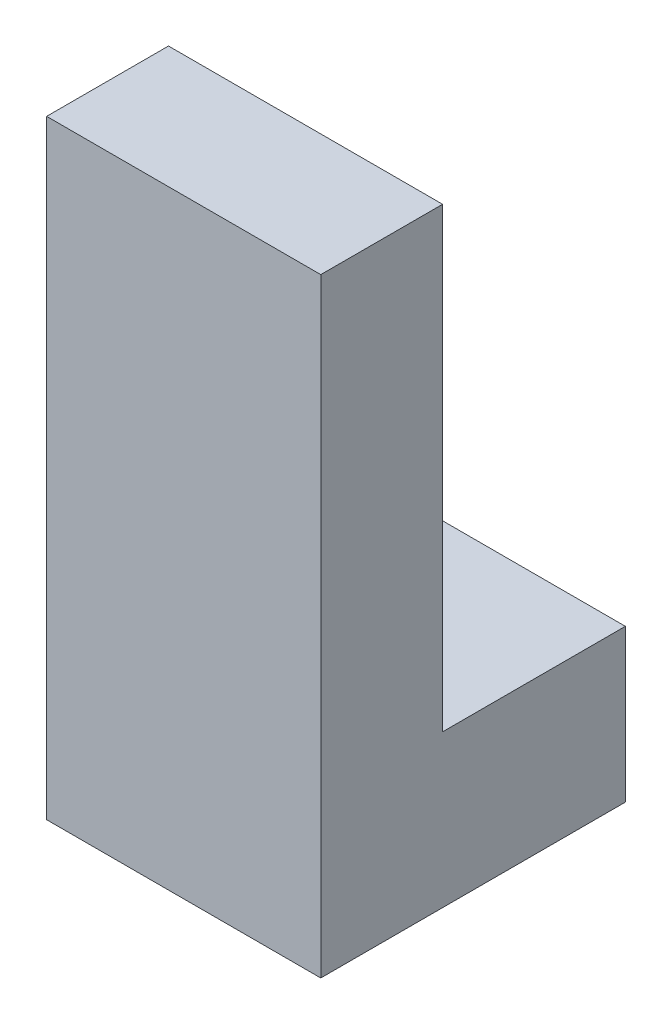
ISO-10303-21;
HEADER;
FILE_DESCRIPTION(('STEP AP214'),'2;1');
FILE_NAME('part.step','',(''),(''),'','','');
FILE_SCHEMA(('AUTOMOTIVE_DESIGN { 1 0 10303 214 1 1 1 1 }'));
ENDSEC;
DATA;
#1=APPLICATION_CONTEXT('core data for automotive mechanical design processes');
#2=APPLICATION_PROTOCOL_DEFINITION('international standard','automotive_design',2000,#1);
#3=PRODUCT_CONTEXT('',#1,'mechanical');
#4=PRODUCT('Part','Part','',(#3));
#5=PRODUCT_RELATED_PRODUCT_CATEGORY('part','',(#4));
#6=PRODUCT_DEFINITION_FORMATION('','',#4);
#7=PRODUCT_DEFINITION_CONTEXT('part definition',#1,'design');
#8=PRODUCT_DEFINITION('design','',#6,#7);
#9=PRODUCT_DEFINITION_SHAPE('','',#8);
#10=(LENGTH_UNIT() NAMED_UNIT(*) SI_UNIT(.MILLI.,.METRE.));
#11=(NAMED_UNIT(*) PLANE_ANGLE_UNIT() SI_UNIT($,.RADIAN.));
#12=(NAMED_UNIT(*) SI_UNIT($,.STERADIAN.) SOLID_ANGLE_UNIT());
#13=UNCERTAINTY_MEASURE_WITH_UNIT(LENGTH_MEASURE(1.E-05),#10,'distance_accuracy_value','');
#14=(GEOMETRIC_REPRESENTATION_CONTEXT(3) GLOBAL_UNCERTAINTY_ASSIGNED_CONTEXT((#13)) GLOBAL_UNIT_ASSIGNED_CONTEXT((#10,
#11,#12)) REPRESENTATION_CONTEXT('',''));
#15=CARTESIAN_POINT('',(0.,0.,0.));
#16=DIRECTION('',(0.,0.,1.));
#17=DIRECTION('',(1.,0.,0.));
#18=AXIS2_PLACEMENT_3D('',#15,#16,#17);
#19=CARTESIAN_POINT('',(0.,8.,0.));
#20=DIRECTION('',(1.,0.,0.));
#21=DIRECTION('',(0.,0.,-1.));
#22=AXIS2_PLACEMENT_3D('',#19,#20,#21);
#23=PLANE('',#22);
#24=DIRECTION('',(0.,1.,0.));
#25=VECTOR('',#24,1.);
#26=CARTESIAN_POINT('',(0.,-4.32666153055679,-1.6));
#27=LINE('',#26,#25);
#28=CARTESIAN_POINT('',(0.,2.,-1.6));
#29=VERTEX_POINT('',#28);
#30=CARTESIAN_POINT('',(0.,8.,-1.6));
#31=VERTEX_POINT('',#30);
#32=EDGE_CURVE('E56',#29,#31,#27,.T.);
#33=ORIENTED_EDGE('',*,*,#32,.F.);
#34=DIRECTION('',(0.,0.,1.));
#35=VECTOR('',#34,1.);
#36=CARTESIAN_POINT('',(0.,2.,-4.));
#37=LINE('',#36,#35);
#38=CARTESIAN_POINT('',(0.,2.,-4.));
#39=VERTEX_POINT('',#38);
#40=EDGE_CURVE('E92',#39,#29,#37,.T.);
#41=ORIENTED_EDGE('',*,*,#40,.F.);
#42=DIRECTION('',(0.,-1.,0.));
#43=VECTOR('',#42,1.);
#44=CARTESIAN_POINT('',(0.,8.,-4.));
#45=LINE('',#44,#43);
#46=CARTESIAN_POINT('',(0.,0.,-4.));
#47=VERTEX_POINT('',#46);
#48=EDGE_CURVE('E85',#39,#47,#45,.T.);
#49=ORIENTED_EDGE('',*,*,#48,.T.);
#50=DIRECTION('',(0.,0.,1.));
#51=VECTOR('',#50,1.);
#52=CARTESIAN_POINT('',(0.,0.,0.));
#53=LINE('',#52,#51);
#54=CARTESIAN_POINT('',(0.,0.,0.));
#55=VERTEX_POINT('',#54);
#56=EDGE_CURVE('E89',#47,#55,#53,.T.);
#57=ORIENTED_EDGE('',*,*,#56,.T.);
#58=DIRECTION('',(0.,-1.,0.));
#59=VECTOR('',#58,1.);
#60=CARTESIAN_POINT('',(0.,8.,0.));
#61=LINE('',#60,#59);
#62=CARTESIAN_POINT('',(0.,8.,0.));
#63=VERTEX_POINT('',#62);
#64=EDGE_CURVE('E12',#63,#55,#61,.T.);
#65=ORIENTED_EDGE('',*,*,#64,.F.);
#66=DIRECTION('',(0.,0.,1.));
#67=VECTOR('',#66,1.);
#68=CARTESIAN_POINT('',(0.,8.,0.));
#69=LINE('',#68,#67);
#70=EDGE_CURVE('E107',#31,#63,#69,.T.);
#71=ORIENTED_EDGE('',*,*,#70,.F.);
#72=EDGE_LOOP('',(#33,#41,#49,#57,#65,#71));
#73=FACE_BOUND('',#72,.T.);
#74=ADVANCED_FACE('F41',(#73),#23,.F.);
#75=CARTESIAN_POINT('',(0.,8.,0.));
#76=DIRECTION('',(0.,0.,-1.));
#77=DIRECTION('',(-1.,0.,0.));
#78=AXIS2_PLACEMENT_3D('',#75,#76,#77);
#79=PLANE('',#78);
#80=DIRECTION('',(1.,0.,0.));
#81=VECTOR('',#80,1.);
#82=CARTESIAN_POINT('',(0.,0.,0.));
#83=LINE('',#82,#81);
#84=CARTESIAN_POINT('',(3.6,0.,0.));
#85=VERTEX_POINT('',#84);
#86=EDGE_CURVE('E111',#55,#85,#83,.T.);
#87=ORIENTED_EDGE('',*,*,#86,.T.);
#88=DIRECTION('',(0.,-1.,0.));
#89=VECTOR('',#88,1.);
#90=CARTESIAN_POINT('',(3.6,8.,0.));
#91=LINE('',#90,#89);
#92=CARTESIAN_POINT('',(3.6,8.,0.));
#93=VERTEX_POINT('',#92);
#94=EDGE_CURVE('E49',#93,#85,#91,.T.);
#95=ORIENTED_EDGE('',*,*,#94,.F.);
#96=DIRECTION('',(1.,0.,0.));
#97=VECTOR('',#96,1.);
#98=CARTESIAN_POINT('',(0.,8.,0.));
#99=LINE('',#98,#97);
#100=EDGE_CURVE('E65',#63,#93,#99,.T.);
#101=ORIENTED_EDGE('',*,*,#100,.F.);
#102=ORIENTED_EDGE('',*,*,#64,.T.);
#103=EDGE_LOOP('',(#87,#95,#101,#102));
#104=FACE_BOUND('',#103,.T.);
#105=ADVANCED_FACE('F131',(#104),#79,.F.);
#106=CARTESIAN_POINT('',(3.6,8.,0.));
#107=DIRECTION('',(-1.,0.,0.));
#108=DIRECTION('',(0.,0.,1.));
#109=AXIS2_PLACEMENT_3D('',#106,#107,#108);
#110=PLANE('',#109);
#111=DIRECTION('',(0.,-1.,0.));
#112=VECTOR('',#111,1.);
#113=CARTESIAN_POINT('',(3.6,8.,-4.));
#114=LINE('',#113,#112);
#115=CARTESIAN_POINT('',(3.6,2.,-4.));
#116=VERTEX_POINT('',#115);
#117=CARTESIAN_POINT('',(3.6,0.,-4.));
#118=VERTEX_POINT('',#117);
#119=EDGE_CURVE('E96',#116,#118,#114,.T.);
#120=ORIENTED_EDGE('',*,*,#119,.F.);
#121=DIRECTION('',(0.,0.,-1.));
#122=VECTOR('',#121,1.);
#123=CARTESIAN_POINT('',(3.6,2.,-4.));
#124=LINE('',#123,#122);
#125=CARTESIAN_POINT('',(3.6,2.,-1.6));
#126=VERTEX_POINT('',#125);
#127=EDGE_CURVE('E141',#126,#116,#124,.T.);
#128=ORIENTED_EDGE('',*,*,#127,.F.);
#129=DIRECTION('',(0.,1.,0.));
#130=VECTOR('',#129,1.);
#131=CARTESIAN_POINT('',(3.6,-4.32666153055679,-1.6));
#132=LINE('',#131,#130);
#133=CARTESIAN_POINT('',(3.6,8.,-1.6));
#134=VERTEX_POINT('',#133);
#135=EDGE_CURVE('E138',#126,#134,#132,.T.);
#136=ORIENTED_EDGE('',*,*,#135,.T.);
#137=DIRECTION('',(0.,0.,-1.));
#138=VECTOR('',#137,1.);
#139=CARTESIAN_POINT('',(3.6,8.,0.));
#140=LINE('',#139,#138);
#141=EDGE_CURVE('E97',#93,#134,#140,.T.);
#142=ORIENTED_EDGE('',*,*,#141,.F.);
#143=ORIENTED_EDGE('',*,*,#94,.T.);
#144=DIRECTION('',(0.,0.,-1.));
#145=VECTOR('',#144,1.);
#146=CARTESIAN_POINT('',(3.6,0.,0.));
#147=LINE('',#146,#145);
#148=EDGE_CURVE('E108',#85,#118,#147,.T.);
#149=ORIENTED_EDGE('',*,*,#148,.T.);
#150=EDGE_LOOP('',(#120,#128,#136,#142,#143,#149));
#151=FACE_BOUND('',#150,.T.);
#152=ADVANCED_FACE('F128',(#151),#110,.F.);
#153=CARTESIAN_POINT('',(0.,8.,-4.));
#154=DIRECTION('',(0.,0.,1.));
#155=DIRECTION('',(1.,0.,0.));
#156=AXIS2_PLACEMENT_3D('',#153,#154,#155);
#157=PLANE('',#156);
#158=ORIENTED_EDGE('',*,*,#48,.F.);
#159=DIRECTION('',(-1.,0.,0.));
#160=VECTOR('',#159,1.);
#161=CARTESIAN_POINT('',(0.,2.,-4.));
#162=LINE('',#161,#160);
#163=EDGE_CURVE('E146',#116,#39,#162,.T.);
#164=ORIENTED_EDGE('',*,*,#163,.F.);
#165=ORIENTED_EDGE('',*,*,#119,.T.);
#166=DIRECTION('',(-1.,0.,0.));
#167=VECTOR('',#166,1.);
#168=CARTESIAN_POINT('',(0.,0.,-4.));
#169=LINE('',#168,#167);
#170=EDGE_CURVE('E100',#118,#47,#169,.T.);
#171=ORIENTED_EDGE('',*,*,#170,.T.);
#172=EDGE_LOOP('',(#158,#164,#165,#171));
#173=FACE_BOUND('',#172,.T.);
#174=ADVANCED_FACE('F101',(#173),#157,.F.);
#175=CARTESIAN_POINT('',(0.,8.,0.));
#176=DIRECTION('',(0.,-1.,0.));
#177=DIRECTION('',(0.,0.,-1.));
#178=AXIS2_PLACEMENT_3D('',#175,#176,#177);
#179=PLANE('',#178);
#180=ORIENTED_EDGE('',*,*,#141,.T.);
#181=DIRECTION('',(1.,0.,0.));
#182=VECTOR('',#181,1.);
#183=CARTESIAN_POINT('',(0.,8.,-1.6));
#184=LINE('',#183,#182);
#185=EDGE_CURVE('E155',#31,#134,#184,.T.);
#186=ORIENTED_EDGE('',*,*,#185,.F.);
#187=ORIENTED_EDGE('',*,*,#70,.T.);
#188=ORIENTED_EDGE('',*,*,#100,.T.);
#189=EDGE_LOOP('',(#180,#186,#187,#188));
#190=FACE_BOUND('',#189,.T.);
#191=ADVANCED_FACE('F162',(#190),#179,.F.);
#192=CARTESIAN_POINT('',(0.,0.,0.));
#193=DIRECTION('',(0.,-1.,0.));
#194=DIRECTION('',(0.,0.,-1.));
#195=AXIS2_PLACEMENT_3D('',#192,#193,#194);
#196=PLANE('',#195);
#197=ORIENTED_EDGE('',*,*,#56,.F.);
#198=ORIENTED_EDGE('',*,*,#170,.F.);
#199=ORIENTED_EDGE('',*,*,#148,.F.);
#200=ORIENTED_EDGE('',*,*,#86,.F.);
#201=EDGE_LOOP('',(#197,#198,#199,#200));
#202=FACE_BOUND('',#201,.T.);
#203=ADVANCED_FACE('F110',(#202),#196,.T.);
#204=CARTESIAN_POINT('',(0.,2.,0.));
#205=DIRECTION('',(0.,-1.,0.));
#206=DIRECTION('',(0.,0.,-1.));
#207=AXIS2_PLACEMENT_3D('',#204,#205,#206);
#208=PLANE('',#207);
#209=ORIENTED_EDGE('',*,*,#40,.T.);
#210=DIRECTION('',(1.,0.,0.));
#211=VECTOR('',#210,1.);
#212=CARTESIAN_POINT('',(0.,2.,-1.6));
#213=LINE('',#212,#211);
#214=EDGE_CURVE('E142',#29,#126,#213,.T.);
#215=ORIENTED_EDGE('',*,*,#214,.T.);
#216=ORIENTED_EDGE('',*,*,#127,.T.);
#217=ORIENTED_EDGE('',*,*,#163,.T.);
#218=EDGE_LOOP('',(#209,#215,#216,#217));
#219=FACE_BOUND('',#218,.T.);
#220=ADVANCED_FACE('F170',(#219),#208,.F.);
#221=CARTESIAN_POINT('',(0.,-4.32666153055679,-1.6));
#222=DIRECTION('',(0.,0.,1.));
#223=DIRECTION('',(1.,0.,0.));
#224=AXIS2_PLACEMENT_3D('',#221,#222,#223);
#225=PLANE('',#224);
#226=ORIENTED_EDGE('',*,*,#32,.T.);
#227=ORIENTED_EDGE('',*,*,#185,.T.);
#228=ORIENTED_EDGE('',*,*,#135,.F.);
#229=ORIENTED_EDGE('',*,*,#214,.F.);
#230=EDGE_LOOP('',(#226,#227,#228,#229));
#231=FACE_BOUND('',#230,.T.);
#232=ADVANCED_FACE('F158',(#231),#225,.F.);
#233=CLOSED_SHELL('',(#74,#105,#152,#174,#191,#203,#220,#232));
#234=MANIFOLD_SOLID_BREP('B2',#233);
#235=ADVANCED_BREP_SHAPE_REPRESENTATION('',(#18,#234),#14);
#236=SHAPE_DEFINITION_REPRESENTATION(#9,#235);
ENDSEC;
END-ISO-10303-21;
